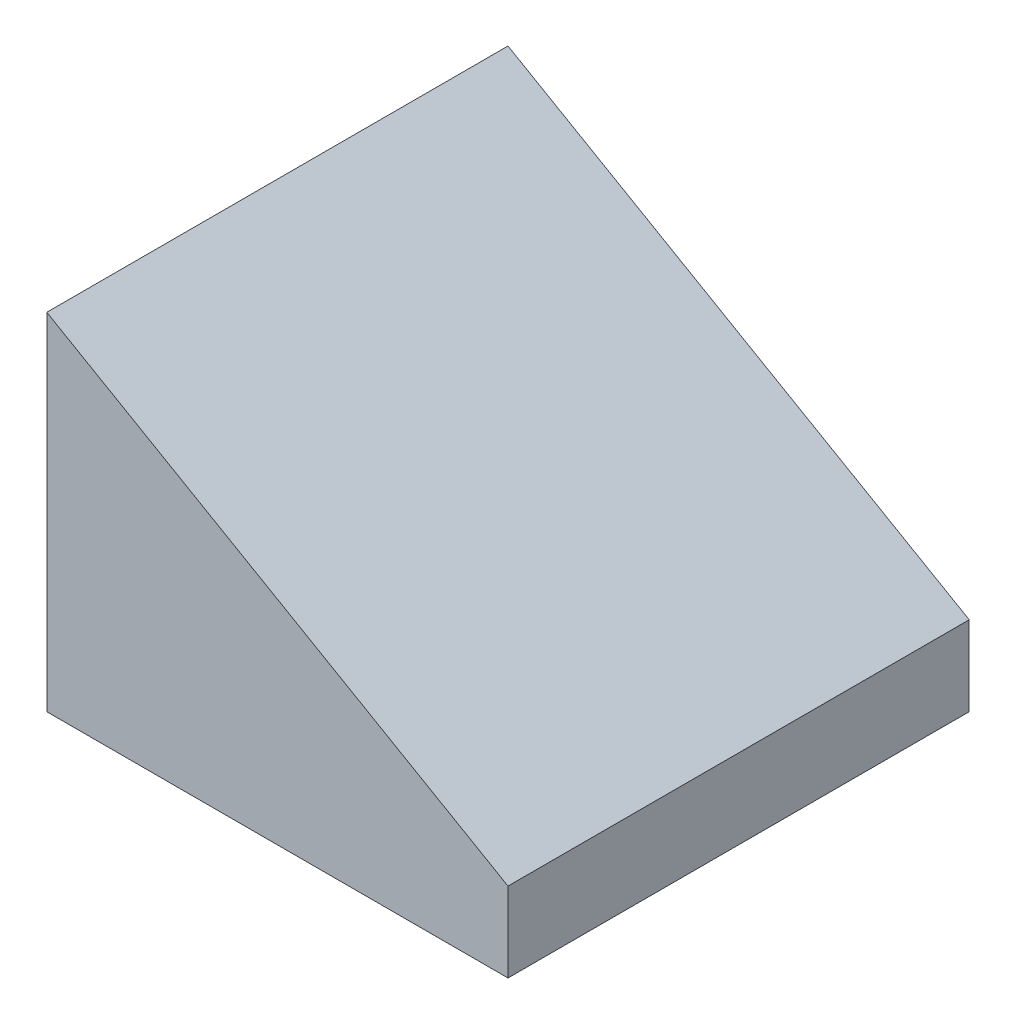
ISO-10303-21;
HEADER;
FILE_DESCRIPTION(('STEP AP214'),'2;1');
FILE_NAME('part.step','',(''),(''),'','','');
FILE_SCHEMA(('AUTOMOTIVE_DESIGN { 1 0 10303 214 1 1 1 1 }'));
ENDSEC;
DATA;
#1=APPLICATION_CONTEXT('core data for automotive mechanical design processes');
#2=APPLICATION_PROTOCOL_DEFINITION('international standard','automotive_design',2000,#1);
#3=PRODUCT_CONTEXT('',#1,'mechanical');
#4=PRODUCT('Part','Part','',(#3));
#5=PRODUCT_RELATED_PRODUCT_CATEGORY('part','',(#4));
#6=PRODUCT_DEFINITION_FORMATION('','',#4);
#7=PRODUCT_DEFINITION_CONTEXT('part definition',#1,'design');
#8=PRODUCT_DEFINITION('design','',#6,#7);
#9=PRODUCT_DEFINITION_SHAPE('','',#8);
#10=(LENGTH_UNIT() NAMED_UNIT(*) SI_UNIT(.MILLI.,.METRE.));
#11=(NAMED_UNIT(*) PLANE_ANGLE_UNIT() SI_UNIT($,.RADIAN.));
#12=(NAMED_UNIT(*) SI_UNIT($,.STERADIAN.) SOLID_ANGLE_UNIT());
#13=UNCERTAINTY_MEASURE_WITH_UNIT(LENGTH_MEASURE(1.E-05),#10,'distance_accuracy_value','');
#14=(GEOMETRIC_REPRESENTATION_CONTEXT(3) GLOBAL_UNCERTAINTY_ASSIGNED_CONTEXT((#13)) GLOBAL_UNIT_ASSIGNED_CONTEXT((#10,
#11,#12)) REPRESENTATION_CONTEXT('',''));
#15=CARTESIAN_POINT('',(0.,0.,0.));
#16=DIRECTION('',(0.,0.,1.));
#17=DIRECTION('',(1.,0.,0.));
#18=AXIS2_PLACEMENT_3D('',#15,#16,#17);
#19=CARTESIAN_POINT('',(8.,1.78119784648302,8.));
#20=DIRECTION('',(-1.,0.,0.));
#21=DIRECTION('',(0.,-1.,0.));
#22=AXIS2_PLACEMENT_3D('',#19,#20,#21);
#23=PLANE('',#22);
#24=DIRECTION('',(0.,0.,-1.));
#25=VECTOR('',#24,1.);
#26=CARTESIAN_POINT('',(8.,0.4,-4.94142135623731));
#27=LINE('',#26,#25);
#28=CARTESIAN_POINT('',(8.,0.4,8.));
#29=VERTEX_POINT('',#28);
#30=CARTESIAN_POINT('',(8.,0.4,0.));
#31=VERTEX_POINT('',#30);
#32=EDGE_CURVE('E183',#29,#31,#27,.T.);
#33=ORIENTED_EDGE('',*,*,#32,.T.);
#34=DIRECTION('',(0.,1.,0.));
#35=VECTOR('',#34,1.);
#36=CARTESIAN_POINT('',(8.,1.78119784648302,0.));
#37=LINE('',#36,#35);
#38=CARTESIAN_POINT('',(8.,1.78119784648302,0.));
#39=VERTEX_POINT('',#38);
#40=EDGE_CURVE('E203',#31,#39,#37,.T.);
#41=ORIENTED_EDGE('',*,*,#40,.T.);
#42=DIRECTION('',(0.,0.,-1.));
#43=VECTOR('',#42,1.);
#44=CARTESIAN_POINT('',(8.,1.78119784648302,8.));
#45=LINE('',#44,#43);
#46=CARTESIAN_POINT('',(8.,1.78119784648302,8.));
#47=VERTEX_POINT('',#46);
#48=EDGE_CURVE('E123',#47,#39,#45,.T.);
#49=ORIENTED_EDGE('',*,*,#48,.F.);
#50=DIRECTION('',(0.,1.,0.));
#51=VECTOR('',#50,1.);
#52=CARTESIAN_POINT('',(8.,1.78119784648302,8.));
#53=LINE('',#52,#51);
#54=EDGE_CURVE('E217',#29,#47,#53,.T.);
#55=ORIENTED_EDGE('',*,*,#54,.F.);
#56=EDGE_LOOP('',(#33,#41,#49,#55));
#57=FACE_BOUND('',#56,.T.);
#58=ADVANCED_FACE('F27',(#57),#23,.F.);
#59=CARTESIAN_POINT('',(0.,0.,8.));
#60=DIRECTION('',(1.,0.,0.));
#61=DIRECTION('',(0.,0.,-1.));
#62=AXIS2_PLACEMENT_3D('',#59,#60,#61);
#63=PLANE('',#62);
#64=DIRECTION('',(0.,0.,-1.));
#65=VECTOR('',#64,1.);
#66=CARTESIAN_POINT('',(0.,0.4,-4.94142135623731));
#67=LINE('',#66,#65);
#68=CARTESIAN_POINT('',(0.,0.4,8.));
#69=VERTEX_POINT('',#68);
#70=CARTESIAN_POINT('',(0.,0.4,0.));
#71=VERTEX_POINT('',#70);
#72=EDGE_CURVE('E179',#69,#71,#67,.T.);
#73=ORIENTED_EDGE('',*,*,#72,.F.);
#74=DIRECTION('',(0.,-1.,0.));
#75=VECTOR('',#74,1.);
#76=CARTESIAN_POINT('',(0.,0.,8.));
#77=LINE('',#76,#75);
#78=CARTESIAN_POINT('',(0.,6.4,8.));
#79=VERTEX_POINT('',#78);
#80=EDGE_CURVE('E221',#79,#69,#77,.T.);
#81=ORIENTED_EDGE('',*,*,#80,.F.);
#82=DIRECTION('',(0.,0.,-1.));
#83=VECTOR('',#82,1.);
#84=CARTESIAN_POINT('',(0.,6.4,8.));
#85=LINE('',#84,#83);
#86=CARTESIAN_POINT('',(0.,6.4,0.));
#87=VERTEX_POINT('',#86);
#88=EDGE_CURVE('E224',#79,#87,#85,.T.);
#89=ORIENTED_EDGE('',*,*,#88,.T.);
#90=DIRECTION('',(0.,-1.,0.));
#91=VECTOR('',#90,1.);
#92=CARTESIAN_POINT('',(0.,0.,0.));
#93=LINE('',#92,#91);
#94=EDGE_CURVE('E214',#87,#71,#93,.T.);
#95=ORIENTED_EDGE('',*,*,#94,.T.);
#96=EDGE_LOOP('',(#73,#81,#89,#95));
#97=FACE_BOUND('',#96,.T.);
#98=ADVANCED_FACE('F243',(#97),#63,.F.);
#99=CARTESIAN_POINT('',(0.,0.,8.));
#100=DIRECTION('',(0.,0.,-1.));
#101=DIRECTION('',(-1.,0.,0.));
#102=AXIS2_PLACEMENT_3D('',#99,#100,#101);
#103=PLANE('',#102);
#104=DIRECTION('',(1.,0.,0.));
#105=VECTOR('',#104,1.);
#106=CARTESIAN_POINT('',(4.,0.4,8.));
#107=LINE('',#106,#105);
#108=EDGE_CURVE('E186',#69,#29,#107,.T.);
#109=ORIENTED_EDGE('',*,*,#108,.T.);
#110=ORIENTED_EDGE('',*,*,#54,.T.);
#111=DIRECTION('',(-0.86602540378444,0.499999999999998,0.));
#112=VECTOR('',#111,1.);
#113=CARTESIAN_POINT('',(0.,6.4,8.));
#114=LINE('',#113,#112);
#115=EDGE_CURVE('E219',#47,#79,#114,.T.);
#116=ORIENTED_EDGE('',*,*,#115,.T.);
#117=ORIENTED_EDGE('',*,*,#80,.T.);
#118=EDGE_LOOP('',(#109,#110,#116,#117));
#119=FACE_BOUND('',#118,.T.);
#120=ADVANCED_FACE('F246',(#119),#103,.F.);
#121=CARTESIAN_POINT('',(0.,0.,0.));
#122=DIRECTION('',(0.,0.,-1.));
#123=DIRECTION('',(-1.,0.,0.));
#124=AXIS2_PLACEMENT_3D('',#121,#122,#123);
#125=PLANE('',#124);
#126=ORIENTED_EDGE('',*,*,#40,.F.);
#127=DIRECTION('',(1.,0.,0.));
#128=VECTOR('',#127,1.);
#129=CARTESIAN_POINT('',(4.,0.4,0.));
#130=LINE('',#129,#128);
#131=EDGE_CURVE('E181',#71,#31,#130,.T.);
#132=ORIENTED_EDGE('',*,*,#131,.F.);
#133=ORIENTED_EDGE('',*,*,#94,.F.);
#134=DIRECTION('',(-0.86602540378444,0.499999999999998,0.));
#135=VECTOR('',#134,1.);
#136=CARTESIAN_POINT('',(0.,6.4,0.));
#137=LINE('',#136,#135);
#138=EDGE_CURVE('E212',#39,#87,#137,.T.);
#139=ORIENTED_EDGE('',*,*,#138,.F.);
#140=EDGE_LOOP('',(#126,#132,#133,#139));
#141=FACE_BOUND('',#140,.T.);
#142=ADVANCED_FACE('F239',(#141),#125,.T.);
#143=CARTESIAN_POINT('',(0.,6.4,8.));
#144=DIRECTION('',(-0.499999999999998,-0.86602540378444,0.));
#145=DIRECTION('',(0.86602540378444,-0.499999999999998,0.));
#146=AXIS2_PLACEMENT_3D('',#143,#144,#145);
#147=PLANE('',#146);
#148=ORIENTED_EDGE('',*,*,#138,.T.);
#149=ORIENTED_EDGE('',*,*,#88,.F.);
#150=ORIENTED_EDGE('',*,*,#115,.F.);
#151=ORIENTED_EDGE('',*,*,#48,.T.);
#152=EDGE_LOOP('',(#148,#149,#150,#151));
#153=FACE_BOUND('',#152,.T.);
#154=ADVANCED_FACE('F232',(#153),#147,.F.);
#155=CARTESIAN_POINT('',(4.,0.4,7.6));
#156=DIRECTION('',(0.,0.,-1.));
#157=DIRECTION('',(-1.,0.,0.));
#158=AXIS2_PLACEMENT_3D('',#155,#156,#157);
#159=PLANE('',#158);
#160=DIRECTION('',(1.,0.,0.));
#161=VECTOR('',#160,1.);
#162=CARTESIAN_POINT('',(4.,0.,7.6));
#163=LINE('',#162,#161);
#164=CARTESIAN_POINT('',(0.400000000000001,0.,7.6));
#165=VERTEX_POINT('',#164);
#166=CARTESIAN_POINT('',(7.6,0.,7.6));
#167=VERTEX_POINT('',#166);
#168=EDGE_CURVE('E165',#165,#167,#163,.T.);
#169=ORIENTED_EDGE('',*,*,#168,.T.);
#170=DIRECTION('',(0.,-1.,0.));
#171=VECTOR('',#170,1.);
#172=CARTESIAN_POINT('',(7.6,0.4,7.6));
#173=LINE('',#172,#171);
#174=CARTESIAN_POINT('',(7.6,0.4,7.6));
#175=VERTEX_POINT('',#174);
#176=EDGE_CURVE('E200',#175,#167,#173,.T.);
#177=ORIENTED_EDGE('',*,*,#176,.F.);
#178=DIRECTION('',(1.,0.,0.));
#179=VECTOR('',#178,1.);
#180=CARTESIAN_POINT('',(4.,0.4,7.6));
#181=LINE('',#180,#179);
#182=CARTESIAN_POINT('',(0.400000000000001,0.4,7.6));
#183=VERTEX_POINT('',#182);
#184=EDGE_CURVE('E189',#183,#175,#181,.T.);
#185=ORIENTED_EDGE('',*,*,#184,.F.);
#186=DIRECTION('',(0.,-1.,0.));
#187=VECTOR('',#186,1.);
#188=CARTESIAN_POINT('',(0.400000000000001,0.4,7.6));
#189=LINE('',#188,#187);
#190=EDGE_CURVE('E201',#183,#165,#189,.T.);
#191=ORIENTED_EDGE('',*,*,#190,.T.);
#192=EDGE_LOOP('',(#169,#177,#185,#191));
#193=FACE_BOUND('',#192,.T.);
#194=ADVANCED_FACE('F257',(#193),#159,.F.);
#195=CARTESIAN_POINT('',(0.400000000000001,0.4,-4.94142135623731));
#196=DIRECTION('',(-1.,0.,0.));
#197=DIRECTION('',(0.,0.,1.));
#198=AXIS2_PLACEMENT_3D('',#195,#196,#197);
#199=PLANE('',#198);
#200=DIRECTION('',(0.,0.,-1.));
#201=VECTOR('',#200,1.);
#202=CARTESIAN_POINT('',(0.400000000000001,0.,-4.94142135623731));
#203=LINE('',#202,#201);
#204=CARTESIAN_POINT('',(0.400000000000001,0.,0.4));
#205=VERTEX_POINT('',#204);
#206=EDGE_CURVE('E176',#165,#205,#203,.T.);
#207=ORIENTED_EDGE('',*,*,#206,.F.);
#208=ORIENTED_EDGE('',*,*,#190,.F.);
#209=DIRECTION('',(0.,0.,-1.));
#210=VECTOR('',#209,1.);
#211=CARTESIAN_POINT('',(0.400000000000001,0.4,-4.94142135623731));
#212=LINE('',#211,#210);
#213=CARTESIAN_POINT('',(0.400000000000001,0.4,0.4));
#214=VERTEX_POINT('',#213);
#215=EDGE_CURVE('E197',#183,#214,#212,.T.);
#216=ORIENTED_EDGE('',*,*,#215,.T.);
#217=DIRECTION('',(0.,-1.,0.));
#218=VECTOR('',#217,1.);
#219=CARTESIAN_POINT('',(0.400000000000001,0.4,0.4));
#220=LINE('',#219,#218);
#221=EDGE_CURVE('E204',#214,#205,#220,.T.);
#222=ORIENTED_EDGE('',*,*,#221,.T.);
#223=EDGE_LOOP('',(#207,#208,#216,#222));
#224=FACE_BOUND('',#223,.T.);
#225=ADVANCED_FACE('F267',(#224),#199,.T.);
#226=CARTESIAN_POINT('',(4.,0.4,0.4));
#227=DIRECTION('',(0.,0.,-1.));
#228=DIRECTION('',(-1.,0.,0.));
#229=AXIS2_PLACEMENT_3D('',#226,#227,#228);
#230=PLANE('',#229);
#231=DIRECTION('',(1.,0.,0.));
#232=VECTOR('',#231,1.);
#233=CARTESIAN_POINT('',(4.,0.,0.4));
#234=LINE('',#233,#232);
#235=CARTESIAN_POINT('',(7.6,0.,0.4));
#236=VERTEX_POINT('',#235);
#237=EDGE_CURVE('E173',#205,#236,#234,.T.);
#238=ORIENTED_EDGE('',*,*,#237,.F.);
#239=ORIENTED_EDGE('',*,*,#221,.F.);
#240=DIRECTION('',(1.,0.,0.));
#241=VECTOR('',#240,1.);
#242=CARTESIAN_POINT('',(4.,0.4,0.4));
#243=LINE('',#242,#241);
#244=CARTESIAN_POINT('',(7.6,0.4,0.4));
#245=VERTEX_POINT('',#244);
#246=EDGE_CURVE('E195',#214,#245,#243,.T.);
#247=ORIENTED_EDGE('',*,*,#246,.T.);
#248=DIRECTION('',(0.,-1.,0.));
#249=VECTOR('',#248,1.);
#250=CARTESIAN_POINT('',(7.6,0.4,0.4));
#251=LINE('',#250,#249);
#252=EDGE_CURVE('E207',#245,#236,#251,.T.);
#253=ORIENTED_EDGE('',*,*,#252,.T.);
#254=EDGE_LOOP('',(#238,#239,#247,#253));
#255=FACE_BOUND('',#254,.T.);
#256=ADVANCED_FACE('F264',(#255),#230,.T.);
#257=CARTESIAN_POINT('',(7.6,0.4,-4.94142135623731));
#258=DIRECTION('',(-1.,0.,0.));
#259=DIRECTION('',(0.,0.,1.));
#260=AXIS2_PLACEMENT_3D('',#257,#258,#259);
#261=PLANE('',#260);
#262=DIRECTION('',(0.,0.,-1.));
#263=VECTOR('',#262,1.);
#264=CARTESIAN_POINT('',(7.6,0.,-4.94142135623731));
#265=LINE('',#264,#263);
#266=EDGE_CURVE('E170',#167,#236,#265,.T.);
#267=ORIENTED_EDGE('',*,*,#266,.T.);
#268=ORIENTED_EDGE('',*,*,#252,.F.);
#269=DIRECTION('',(0.,0.,-1.));
#270=VECTOR('',#269,1.);
#271=CARTESIAN_POINT('',(7.6,0.4,-4.94142135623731));
#272=LINE('',#271,#270);
#273=EDGE_CURVE('E192',#175,#245,#272,.T.);
#274=ORIENTED_EDGE('',*,*,#273,.F.);
#275=ORIENTED_EDGE('',*,*,#176,.T.);
#276=EDGE_LOOP('',(#267,#268,#274,#275));
#277=FACE_BOUND('',#276,.T.);
#278=ADVANCED_FACE('F251',(#277),#261,.F.);
#279=CARTESIAN_POINT('',(4.,0.4,-4.94142135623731));
#280=DIRECTION('',(0.,-1.,0.));
#281=DIRECTION('',(1.,0.,0.));
#282=AXIS2_PLACEMENT_3D('',#279,#280,#281);
#283=PLANE('',#282);
#284=ORIENTED_EDGE('',*,*,#72,.T.);
#285=ORIENTED_EDGE('',*,*,#131,.T.);
#286=ORIENTED_EDGE('',*,*,#32,.F.);
#287=ORIENTED_EDGE('',*,*,#108,.F.);
#288=EDGE_LOOP('',(#284,#285,#286,#287));
#289=FACE_BOUND('',#288,.T.);
#290=ORIENTED_EDGE('',*,*,#184,.T.);
#291=ORIENTED_EDGE('',*,*,#273,.T.);
#292=ORIENTED_EDGE('',*,*,#246,.F.);
#293=ORIENTED_EDGE('',*,*,#215,.F.);
#294=EDGE_LOOP('',(#290,#291,#292,#293));
#295=FACE_BOUND('',#294,.T.);
#296=ADVANCED_FACE('F248',(#289,#295),#283,.T.);
#297=CARTESIAN_POINT('',(8.,0.,8.));
#298=DIRECTION('',(0.,1.,0.));
#299=DIRECTION('',(-1.,0.,0.));
#300=AXIS2_PLACEMENT_3D('',#297,#298,#299);
#301=PLANE('',#300);
#302=DIRECTION('',(0.,0.,-1.));
#303=VECTOR('',#302,1.);
#304=CARTESIAN_POINT('',(1.5,0.,6.5));
#305=LINE('',#304,#303);
#306=CARTESIAN_POINT('',(1.5,0.,6.5));
#307=VERTEX_POINT('',#306);
#308=CARTESIAN_POINT('',(1.5,0.,1.5));
#309=VERTEX_POINT('',#308);
#310=EDGE_CURVE('E162',#307,#309,#305,.T.);
#311=ORIENTED_EDGE('',*,*,#310,.F.);
#312=DIRECTION('',(-1.,0.,0.));
#313=VECTOR('',#312,1.);
#314=CARTESIAN_POINT('',(1.5,0.,6.5));
#315=LINE('',#314,#313);
#316=CARTESIAN_POINT('',(6.5,0.,6.5));
#317=VERTEX_POINT('',#316);
#318=EDGE_CURVE('E148',#317,#307,#315,.T.);
#319=ORIENTED_EDGE('',*,*,#318,.F.);
#320=DIRECTION('',(0.,0.,-1.));
#321=VECTOR('',#320,1.);
#322=CARTESIAN_POINT('',(6.5,0.,6.5));
#323=LINE('',#322,#321);
#324=CARTESIAN_POINT('',(6.5,0.,1.5));
#325=VERTEX_POINT('',#324);
#326=EDGE_CURVE('E163',#317,#325,#323,.T.);
#327=ORIENTED_EDGE('',*,*,#326,.T.);
#328=DIRECTION('',(-1.,0.,0.));
#329=VECTOR('',#328,1.);
#330=CARTESIAN_POINT('',(1.5,0.,1.5));
#331=LINE('',#330,#329);
#332=EDGE_CURVE('E126',#325,#309,#331,.T.);
#333=ORIENTED_EDGE('',*,*,#332,.T.);
#334=EDGE_LOOP('',(#311,#319,#327,#333));
#335=FACE_BOUND('',#334,.T.);
#336=ORIENTED_EDGE('',*,*,#266,.F.);
#337=ORIENTED_EDGE('',*,*,#168,.F.);
#338=ORIENTED_EDGE('',*,*,#206,.T.);
#339=ORIENTED_EDGE('',*,*,#237,.T.);
#340=EDGE_LOOP('',(#336,#337,#338,#339));
#341=FACE_BOUND('',#340,.T.);
#342=ADVANCED_FACE('F29',(#335,#341),#301,.F.);
#343=CARTESIAN_POINT('',(6.5,0.,6.5));
#344=DIRECTION('',(1.,0.,0.));
#345=DIRECTION('',(0.,0.,-1.));
#346=AXIS2_PLACEMENT_3D('',#343,#344,#345);
#347=PLANE('',#346);
#348=DIRECTION('',(0.,-1.,0.));
#349=VECTOR('',#348,1.);
#350=CARTESIAN_POINT('',(6.5,0.,1.5));
#351=LINE('',#350,#349);
#352=CARTESIAN_POINT('',(6.5,1.6,1.5));
#353=VERTEX_POINT('',#352);
#354=EDGE_CURVE('E141',#353,#325,#351,.T.);
#355=ORIENTED_EDGE('',*,*,#354,.T.);
#356=ORIENTED_EDGE('',*,*,#326,.F.);
#357=DIRECTION('',(0.,-1.,0.));
#358=VECTOR('',#357,1.);
#359=CARTESIAN_POINT('',(6.5,0.,6.5));
#360=LINE('',#359,#358);
#361=CARTESIAN_POINT('',(6.5,1.6,6.5));
#362=VERTEX_POINT('',#361);
#363=EDGE_CURVE('E159',#362,#317,#360,.T.);
#364=ORIENTED_EDGE('',*,*,#363,.F.);
#365=DIRECTION('',(0.,0.,-1.));
#366=VECTOR('',#365,1.);
#367=CARTESIAN_POINT('',(6.5,1.6,6.5));
#368=LINE('',#367,#366);
#369=EDGE_CURVE('E138',#362,#353,#368,.T.);
#370=ORIENTED_EDGE('',*,*,#369,.T.);
#371=EDGE_LOOP('',(#355,#356,#364,#370));
#372=FACE_BOUND('',#371,.T.);
#373=ADVANCED_FACE('F132',(#372),#347,.F.);
#374=CARTESIAN_POINT('',(6.5,1.6,6.5));
#375=DIRECTION('',(0.5,0.866025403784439,0.));
#376=DIRECTION('',(-0.866025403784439,0.5,0.));
#377=AXIS2_PLACEMENT_3D('',#374,#375,#376);
#378=PLANE('',#377);
#379=DIRECTION('',(0.,0.,-1.));
#380=VECTOR('',#379,1.);
#381=CARTESIAN_POINT('',(5.46076951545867,2.2,6.5));
#382=LINE('',#381,#380);
#383=CARTESIAN_POINT('',(5.46076951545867,2.2,5.96688902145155));
#384=VERTEX_POINT('',#383);
#385=CARTESIAN_POINT('',(5.46076951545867,2.2,2.03311097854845));
#386=VERTEX_POINT('',#385);
#387=EDGE_CURVE('E35',#384,#386,#382,.T.);
#388=ORIENTED_EDGE('',*,*,#387,.F.);
#389=CARTESIAN_POINT('',(4.,3.04337567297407,4.));
#390=DIRECTION('',(0.5,0.866025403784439,0.));
#391=DIRECTION('',(0.866025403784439,-0.5,0.));
#392=AXIS2_PLACEMENT_3D('',#389,#390,#391);
#393=ELLIPSE('',#392,2.82901631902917,2.45);
#394=EDGE_CURVE('E11',#384,#386,#393,.T.);
#395=ORIENTED_EDGE('',*,*,#394,.T.);
#396=EDGE_LOOP('',(#388,#395));
#397=FACE_BOUND('',#396,.T.);
#398=DIRECTION('',(0.866025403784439,-0.5,0.));
#399=VECTOR('',#398,1.);
#400=CARTESIAN_POINT('',(6.5,1.6,1.5));
#401=LINE('',#400,#399);
#402=CARTESIAN_POINT('',(1.5,4.48675134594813,1.5));
#403=VERTEX_POINT('',#402);
#404=EDGE_CURVE('E135',#403,#353,#401,.T.);
#405=ORIENTED_EDGE('',*,*,#404,.T.);
#406=ORIENTED_EDGE('',*,*,#369,.F.);
#407=DIRECTION('',(0.866025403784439,-0.5,0.));
#408=VECTOR('',#407,1.);
#409=CARTESIAN_POINT('',(6.5,1.6,6.5));
#410=LINE('',#409,#408);
#411=CARTESIAN_POINT('',(1.5,4.48675134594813,6.5));
#412=VERTEX_POINT('',#411);
#413=EDGE_CURVE('E157',#412,#362,#410,.T.);
#414=ORIENTED_EDGE('',*,*,#413,.F.);
#415=DIRECTION('',(0.,0.,-1.));
#416=VECTOR('',#415,1.);
#417=CARTESIAN_POINT('',(1.5,4.48675134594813,6.5));
#418=LINE('',#417,#416);
#419=EDGE_CURVE('E140',#412,#403,#418,.T.);
#420=ORIENTED_EDGE('',*,*,#419,.T.);
#421=EDGE_LOOP('',(#405,#406,#414,#420));
#422=FACE_BOUND('',#421,.T.);
#423=ADVANCED_FACE('F128',(#397,#422),#378,.F.);
#424=CARTESIAN_POINT('',(1.5,4.48675134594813,6.5));
#425=DIRECTION('',(-1.,0.,0.));
#426=DIRECTION('',(0.,-1.,0.));
#427=AXIS2_PLACEMENT_3D('',#424,#425,#426);
#428=PLANE('',#427);
#429=DIRECTION('',(0.,1.,0.));
#430=VECTOR('',#429,1.);
#431=CARTESIAN_POINT('',(1.5,4.48675134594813,1.5));
#432=LINE('',#431,#430);
#433=EDGE_CURVE('E49',#309,#403,#432,.T.);
#434=ORIENTED_EDGE('',*,*,#433,.T.);
#435=ORIENTED_EDGE('',*,*,#419,.F.);
#436=DIRECTION('',(0.,1.,0.));
#437=VECTOR('',#436,1.);
#438=CARTESIAN_POINT('',(1.5,4.48675134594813,6.5));
#439=LINE('',#438,#437);
#440=EDGE_CURVE('E151',#307,#412,#439,.T.);
#441=ORIENTED_EDGE('',*,*,#440,.F.);
#442=ORIENTED_EDGE('',*,*,#310,.T.);
#443=EDGE_LOOP('',(#434,#435,#441,#442));
#444=FACE_BOUND('',#443,.T.);
#445=ADVANCED_FACE('F131',(#444),#428,.F.);
#446=CARTESIAN_POINT('',(6.5,0.,6.5));
#447=DIRECTION('',(0.,0.,1.));
#448=DIRECTION('',(1.,0.,0.));
#449=AXIS2_PLACEMENT_3D('',#446,#447,#448);
#450=PLANE('',#449);
#451=ORIENTED_EDGE('',*,*,#318,.T.);
#452=ORIENTED_EDGE('',*,*,#440,.T.);
#453=ORIENTED_EDGE('',*,*,#413,.T.);
#454=ORIENTED_EDGE('',*,*,#363,.T.);
#455=EDGE_LOOP('',(#451,#452,#453,#454));
#456=FACE_BOUND('',#455,.T.);
#457=ADVANCED_FACE('F297',(#456),#450,.F.);
#458=CARTESIAN_POINT('',(6.5,0.,1.5));
#459=DIRECTION('',(0.,0.,1.));
#460=DIRECTION('',(1.,0.,0.));
#461=AXIS2_PLACEMENT_3D('',#458,#459,#460);
#462=PLANE('',#461);
#463=ORIENTED_EDGE('',*,*,#332,.F.);
#464=ORIENTED_EDGE('',*,*,#354,.F.);
#465=ORIENTED_EDGE('',*,*,#404,.F.);
#466=ORIENTED_EDGE('',*,*,#433,.F.);
#467=EDGE_LOOP('',(#463,#464,#465,#466));
#468=FACE_BOUND('',#467,.T.);
#469=ADVANCED_FACE('F144',(#468),#462,.T.);
#470=CARTESIAN_POINT('',(4.,2.2,4.));
#471=DIRECTION('',(0.,-1.,0.));
#472=DIRECTION('',(1.,0.,0.));
#473=AXIS2_PLACEMENT_3D('',#470,#471,#472);
#474=CYLINDRICAL_SURFACE('',#473,2.45);
#475=CARTESIAN_POINT('',(4.,2.2,4.));
#476=DIRECTION('',(0.,-1.,0.));
#477=DIRECTION('',(1.,0.,0.));
#478=AXIS2_PLACEMENT_3D('',#475,#476,#477);
#479=CIRCLE('',#478,2.45);
#480=EDGE_CURVE('E41',#386,#384,#479,.T.);
#481=ORIENTED_EDGE('',*,*,#480,.F.);
#482=ORIENTED_EDGE('',*,*,#394,.F.);
#483=EDGE_LOOP('',(#481,#482));
#484=FACE_BOUND('',#483,.T.);
#485=ADVANCED_FACE('F125',(#484),#474,.F.);
#486=CARTESIAN_POINT('',(4.,2.2,4.));
#487=DIRECTION('',(0.,-1.,0.));
#488=DIRECTION('',(1.,0.,0.));
#489=AXIS2_PLACEMENT_3D('',#486,#487,#488);
#490=PLANE('',#489);
#491=ORIENTED_EDGE('',*,*,#387,.T.);
#492=ORIENTED_EDGE('',*,*,#480,.T.);
#493=EDGE_LOOP('',(#491,#492));
#494=FACE_BOUND('',#493,.T.);
#495=ADVANCED_FACE('F121',(#494),#490,.T.);
#496=CLOSED_SHELL('',(#58,#98,#120,#142,#154,#194,#225,#256,#278,#296,#342,#373,#423,#445,#457,
#469,#485,#495));
#497=MANIFOLD_SOLID_BREP('B2',#496);
#498=ADVANCED_BREP_SHAPE_REPRESENTATION('',(#18,#497),#14);
#499=SHAPE_DEFINITION_REPRESENTATION(#9,#498);
ENDSEC;
END-ISO-10303-21;
